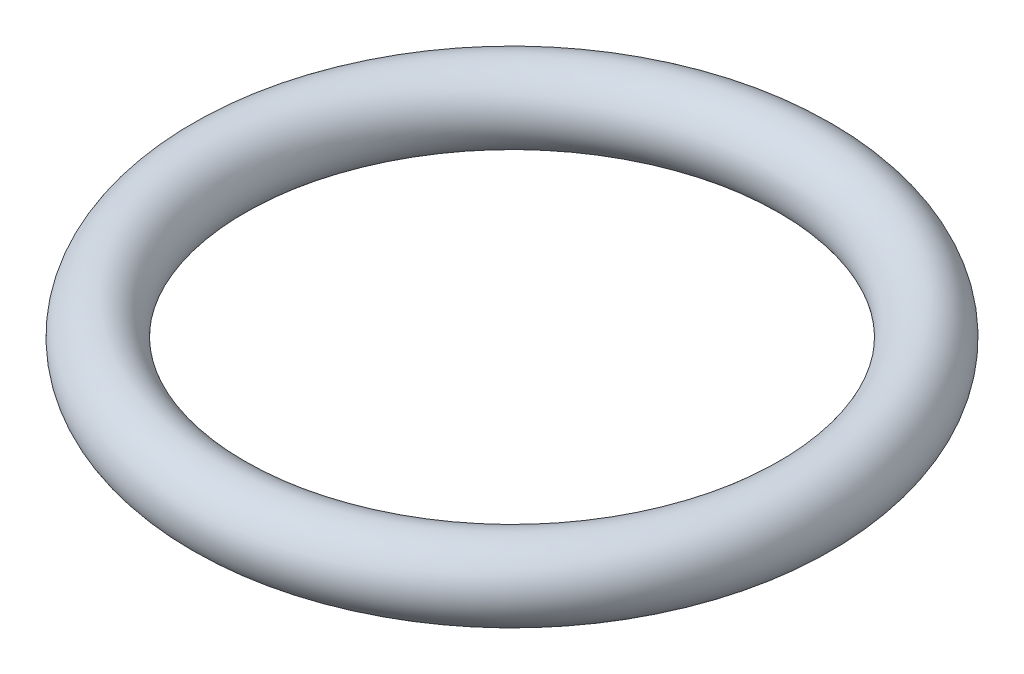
ISO-10303-21;
HEADER;
FILE_DESCRIPTION(('STEP AP214'),'2;1');
FILE_NAME('part.step','',(''),(''),'','','');
FILE_SCHEMA(('AUTOMOTIVE_DESIGN { 1 0 10303 214 1 1 1 1 }'));
ENDSEC;
DATA;
#1=APPLICATION_CONTEXT('core data for automotive mechanical design processes');
#2=APPLICATION_PROTOCOL_DEFINITION('international standard','automotive_design',2000,#1);
#3=PRODUCT_CONTEXT('',#1,'mechanical');
#4=PRODUCT('Part','Part','',(#3));
#5=PRODUCT_RELATED_PRODUCT_CATEGORY('part','',(#4));
#6=PRODUCT_DEFINITION_FORMATION('','',#4);
#7=PRODUCT_DEFINITION_CONTEXT('part definition',#1,'design');
#8=PRODUCT_DEFINITION('design','',#6,#7);
#9=PRODUCT_DEFINITION_SHAPE('','',#8);
#10=(LENGTH_UNIT() NAMED_UNIT(*) SI_UNIT(.MILLI.,.METRE.));
#11=(NAMED_UNIT(*) PLANE_ANGLE_UNIT() SI_UNIT($,.RADIAN.));
#12=(NAMED_UNIT(*) SI_UNIT($,.STERADIAN.) SOLID_ANGLE_UNIT());
#13=UNCERTAINTY_MEASURE_WITH_UNIT(LENGTH_MEASURE(1.E-05),#10,'distance_accuracy_value','');
#14=(GEOMETRIC_REPRESENTATION_CONTEXT(3) GLOBAL_UNCERTAINTY_ASSIGNED_CONTEXT((#13)) GLOBAL_UNIT_ASSIGNED_CONTEXT((#10,
#11,#12)) REPRESENTATION_CONTEXT('',''));
#15=CARTESIAN_POINT('',(0.,0.,0.));
#16=DIRECTION('',(0.,0.,1.));
#17=DIRECTION('',(1.,0.,0.));
#18=AXIS2_PLACEMENT_3D('',#15,#16,#17);
#19=CARTESIAN_POINT('',(0.,1.5,0.));
#20=DIRECTION('',(0.,-1.,0.));
#21=DIRECTION('',(0.,0.,-1.));
#22=AXIS2_PLACEMENT_3D('',#19,#20,#21);
#23=TOROIDAL_SURFACE('',#22,12.,1.5);
#24=CARTESIAN_POINT('',(0.,1.5,-13.5));
#25=VERTEX_POINT('',#24);
#26=VERTEX_LOOP('',#25);
#27=FACE_BOUND('',#26,.T.);
#28=ADVANCED_FACE('F28',(#27),#23,.T.);
#29=CLOSED_SHELL('',(#28));
#30=MANIFOLD_SOLID_BREP('B2',#29);
#31=ADVANCED_BREP_SHAPE_REPRESENTATION('',(#18,#30),#14);
#32=SHAPE_DEFINITION_REPRESENTATION(#9,#31);
ENDSEC;
END-ISO-10303-21;
